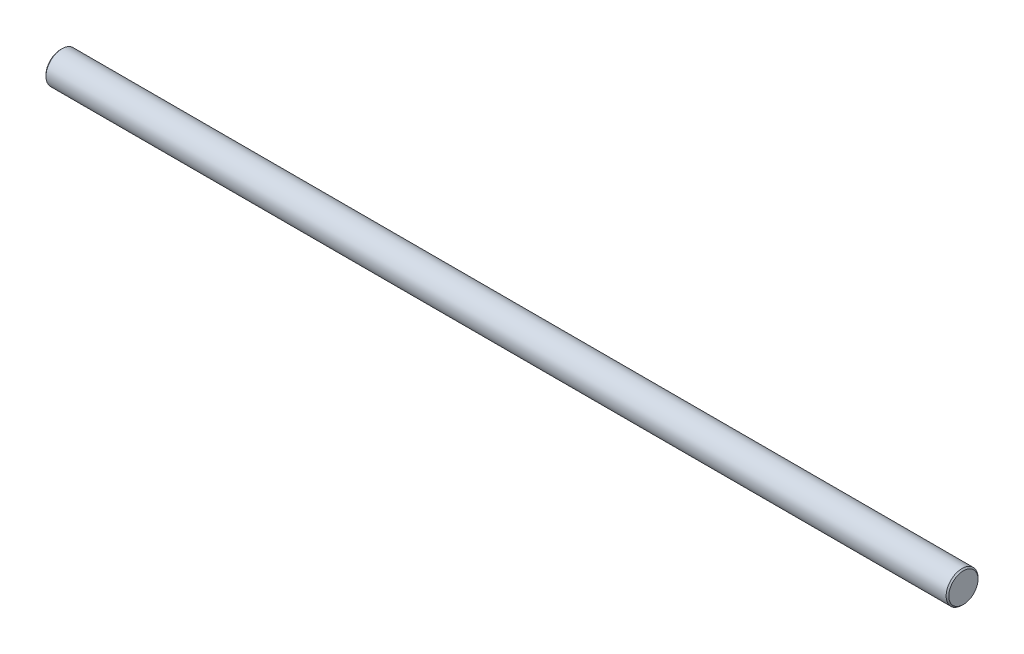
ISO-10303-21;
HEADER;
FILE_DESCRIPTION(('STEP AP214'),'2;1');
FILE_NAME('part.step','',(''),(''),'','','');
FILE_SCHEMA(('AUTOMOTIVE_DESIGN { 1 0 10303 214 1 1 1 1 }'));
ENDSEC;
DATA;
#1=APPLICATION_CONTEXT('core data for automotive mechanical design processes');
#2=APPLICATION_PROTOCOL_DEFINITION('international standard','automotive_design',2000,#1);
#3=PRODUCT_CONTEXT('',#1,'mechanical');
#4=PRODUCT('Part','Part','',(#3));
#5=PRODUCT_RELATED_PRODUCT_CATEGORY('part','',(#4));
#6=PRODUCT_DEFINITION_FORMATION('','',#4);
#7=PRODUCT_DEFINITION_CONTEXT('part definition',#1,'design');
#8=PRODUCT_DEFINITION('design','',#6,#7);
#9=PRODUCT_DEFINITION_SHAPE('','',#8);
#10=(LENGTH_UNIT() NAMED_UNIT(*) SI_UNIT(.MILLI.,.METRE.));
#11=(NAMED_UNIT(*) PLANE_ANGLE_UNIT() SI_UNIT($,.RADIAN.));
#12=(NAMED_UNIT(*) SI_UNIT($,.STERADIAN.) SOLID_ANGLE_UNIT());
#13=UNCERTAINTY_MEASURE_WITH_UNIT(LENGTH_MEASURE(1.E-05),#10,'distance_accuracy_value','');
#14=(GEOMETRIC_REPRESENTATION_CONTEXT(3) GLOBAL_UNCERTAINTY_ASSIGNED_CONTEXT((#13)) GLOBAL_UNIT_ASSIGNED_CONTEXT((#10,
#11,#12)) REPRESENTATION_CONTEXT('',''));
#15=CARTESIAN_POINT('',(0.,0.,0.));
#16=DIRECTION('',(0.,0.,1.));
#17=DIRECTION('',(1.,0.,0.));
#18=AXIS2_PLACEMENT_3D('',#15,#16,#17);
#19=CARTESIAN_POINT('',(170.,0.,0.));
#20=DIRECTION('',(1.,0.,0.));
#21=DIRECTION('',(0.,0.,-1.));
#22=AXIS2_PLACEMENT_3D('',#19,#20,#21);
#23=PLANE('',#22);
#24=CARTESIAN_POINT('',(170.000000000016,0.,0.));
#25=DIRECTION('',(-1.,0.,0.));
#26=DIRECTION('',(0.,0.,1.));
#27=AXIS2_PLACEMENT_3D('',#24,#25,#26);
#28=CIRCLE('',#27,5.49999999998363);
#29=CARTESIAN_POINT('',(170.000000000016,0.,5.49999999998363));
#30=VERTEX_POINT('',#29);
#31=EDGE_CURVE('E18',#30,#30,#28,.T.);
#32=ORIENTED_EDGE('',*,*,#31,.F.);
#33=EDGE_LOOP('',(#32));
#34=FACE_BOUND('',#33,.T.);
#35=ADVANCED_FACE('F15',(#34),#23,.T.);
#36=CARTESIAN_POINT('',(-170.,0.,0.));
#37=DIRECTION('',(1.,0.,0.));
#38=DIRECTION('',(0.,0.,-1.));
#39=AXIS2_PLACEMENT_3D('',#36,#37,#38);
#40=PLANE('',#39);
#41=CARTESIAN_POINT('',(-170.000000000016,0.,0.));
#42=DIRECTION('',(1.,0.,0.));
#43=DIRECTION('',(0.,0.,-1.));
#44=AXIS2_PLACEMENT_3D('',#41,#42,#43);
#45=CIRCLE('',#44,5.49999999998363);
#46=CARTESIAN_POINT('',(-170.000000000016,0.,-5.49999999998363));
#47=VERTEX_POINT('',#46);
#48=EDGE_CURVE('E32',#47,#47,#45,.T.);
#49=ORIENTED_EDGE('',*,*,#48,.F.);
#50=EDGE_LOOP('',(#49));
#51=FACE_BOUND('',#50,.T.);
#52=ADVANCED_FACE('F43',(#51),#40,.F.);
#53=CARTESIAN_POINT('',(169.499999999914,0.,0.));
#54=DIRECTION('',(-1.,0.,0.));
#55=DIRECTION('',(0.,0.,1.));
#56=AXIS2_PLACEMENT_3D('',#53,#54,#55);
#57=CONICAL_SURFACE('',#56,6.00000000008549,0.785398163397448);
#58=CARTESIAN_POINT('',(169.5,0.,0.));
#59=DIRECTION('',(1.,0.,0.));
#60=DIRECTION('',(0.,0.,-1.));
#61=AXIS2_PLACEMENT_3D('',#58,#59,#60);
#62=CIRCLE('',#61,6.);
#63=CARTESIAN_POINT('',(169.5,0.,-6.));
#64=VERTEX_POINT('',#63);
#65=EDGE_CURVE('E23',#64,#64,#62,.F.);
#66=ORIENTED_EDGE('',*,*,#65,.F.);
#67=EDGE_LOOP('',(#66));
#68=FACE_BOUND('',#67,.T.);
#69=ORIENTED_EDGE('',*,*,#31,.T.);
#70=EDGE_LOOP('',(#69));
#71=FACE_BOUND('',#70,.T.);
#72=ADVANCED_FACE('F40',(#68,#71),#57,.T.);
#73=CARTESIAN_POINT('',(-169.499999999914,0.,0.));
#74=DIRECTION('',(1.,0.,0.));
#75=DIRECTION('',(0.,0.,-1.));
#76=AXIS2_PLACEMENT_3D('',#73,#74,#75);
#77=CONICAL_SURFACE('',#76,6.00000000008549,0.785398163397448);
#78=CARTESIAN_POINT('',(-169.5,0.,0.));
#79=DIRECTION('',(1.,0.,0.));
#80=DIRECTION('',(0.,0.,-1.));
#81=AXIS2_PLACEMENT_3D('',#78,#79,#80);
#82=CIRCLE('',#81,6.);
#83=CARTESIAN_POINT('',(-169.5,0.,-6.));
#84=VERTEX_POINT('',#83);
#85=EDGE_CURVE('E10',#84,#84,#82,.T.);
#86=ORIENTED_EDGE('',*,*,#85,.F.);
#87=EDGE_LOOP('',(#86));
#88=FACE_BOUND('',#87,.T.);
#89=ORIENTED_EDGE('',*,*,#48,.T.);
#90=EDGE_LOOP('',(#89));
#91=FACE_BOUND('',#90,.T.);
#92=ADVANCED_FACE('F51',(#88,#91),#77,.T.);
#93=CARTESIAN_POINT('',(-170.,0.,0.));
#94=DIRECTION('',(1.,0.,0.));
#95=DIRECTION('',(0.,0.,-1.));
#96=AXIS2_PLACEMENT_3D('',#93,#94,#95);
#97=CYLINDRICAL_SURFACE('',#96,6.);
#98=ORIENTED_EDGE('',*,*,#65,.T.);
#99=EDGE_LOOP('',(#98));
#100=FACE_BOUND('',#99,.T.);
#101=ORIENTED_EDGE('',*,*,#85,.T.);
#102=EDGE_LOOP('',(#101));
#103=FACE_BOUND('',#102,.T.);
#104=ADVANCED_FACE('F49',(#100,#103),#97,.T.);
#105=CLOSED_SHELL('',(#35,#52,#72,#92,#104));
#106=MANIFOLD_SOLID_BREP('B1',#105);
#107=ADVANCED_BREP_SHAPE_REPRESENTATION('',(#18,#106),#14);
#108=SHAPE_DEFINITION_REPRESENTATION(#9,#107);
ENDSEC;
END-ISO-10303-21;
